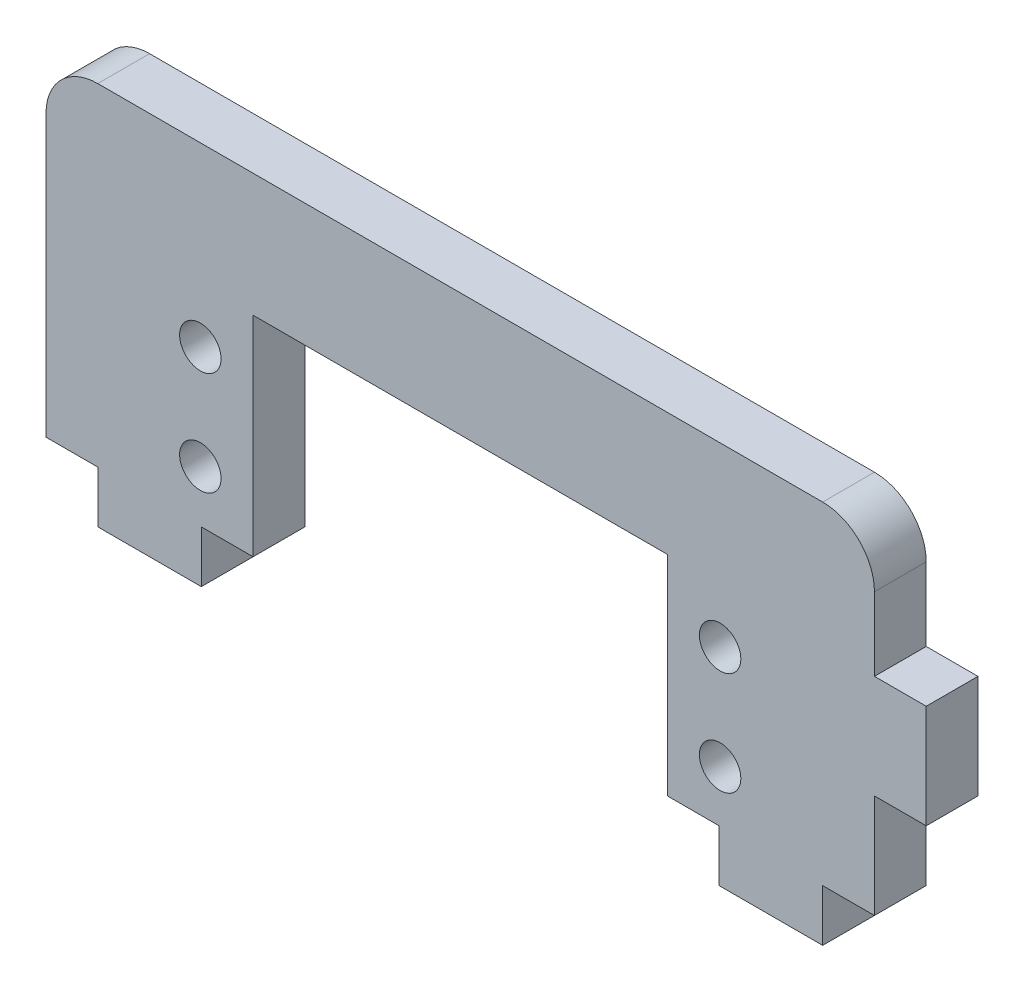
from build123d import *

# Parameters (mm, degrees)
BOSS_EXTRU_1_DEPTH      = 5
ESQUISSE2_R             = 2
ENL_V_MAT_EXTRU_1_DEPTH = 5
ESQUISSE3_W             = 10
ESQUISSE3_H             = 5
BOSS_EXTRU_2_DEPTH      = 5
ESQUISSE4_W             = 5
ESQUISSE4_H             = 10
BOSS_EXTRU_3_DEPTH      = 5


with BuildPart() as part:
    # Esquisse1 → Boss.-Extru.1 (new body)
    with BuildSketch(Plane.XY):
        with BuildLine():
            Line((60, 0), (80, 0))
            Line((80, 0), (80, 27.075307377))
            ThreePointArc((80, 27.075307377), (78.535533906, 30.610841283), (75, 32.075307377))
            Line((75, 32.075307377), (5, 32.075307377))
            ThreePointArc((5, 32.075307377), (1.464466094, 30.610841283), (0, 27.075307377))
            Line((0, 27.075307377), (0, 0))
            Line((0, 0), (20, 0))
            Line((20, 0), (20, 20.2))
            Line((20, 20.2), (60, 20.2))
            Line((60, 20.2), (60, 0))
        make_face()
    extrude(amount=BOSS_EXTRU_1_DEPTH)

    # Esquisse2 → Enl_v. mat.-Extru.1 (cut)
    with BuildSketch(Plane.XY.offset(5)):
        with Locations((65.097103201, 15)):
            Circle(ESQUISSE2_R)
        with Locations((65.097103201, 5)):
            Circle(ESQUISSE2_R)
        with Locations(Location((14.902896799, 5, 0), (0, 0, 180))):
            Circle(ESQUISSE2_R)
        with Locations(Location((14.902896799, 15, 0), (0, 0, 180))):
            Circle(ESQUISSE2_R)
    extrude(amount=-ENL_V_MAT_EXTRU_1_DEPTH, mode=Mode.SUBTRACT)

    # Esquisse3 → Boss.-Extru.2 (add)
    with BuildSketch(Plane.XZ):
        with Locations((10, 2.5)):
            Rectangle(ESQUISSE3_W, ESQUISSE3_H)
        with Locations((70, 2.5)):
            Rectangle(ESQUISSE3_W, ESQUISSE3_H)
    extrude(amount=BOSS_EXTRU_2_DEPTH)

    # Esquisse4 → Boss.-Extru.3 (add)
    with BuildSketch(Plane(origin=(80, 0, 0), x_dir=(0, 0, -1), z_dir=(1, 0, 0))):
        with Locations((-2.5, 15)):
            Rectangle(ESQUISSE4_W, ESQUISSE4_H)
    extrude(amount=BOSS_EXTRU_3_DEPTH)


solid = part.part
